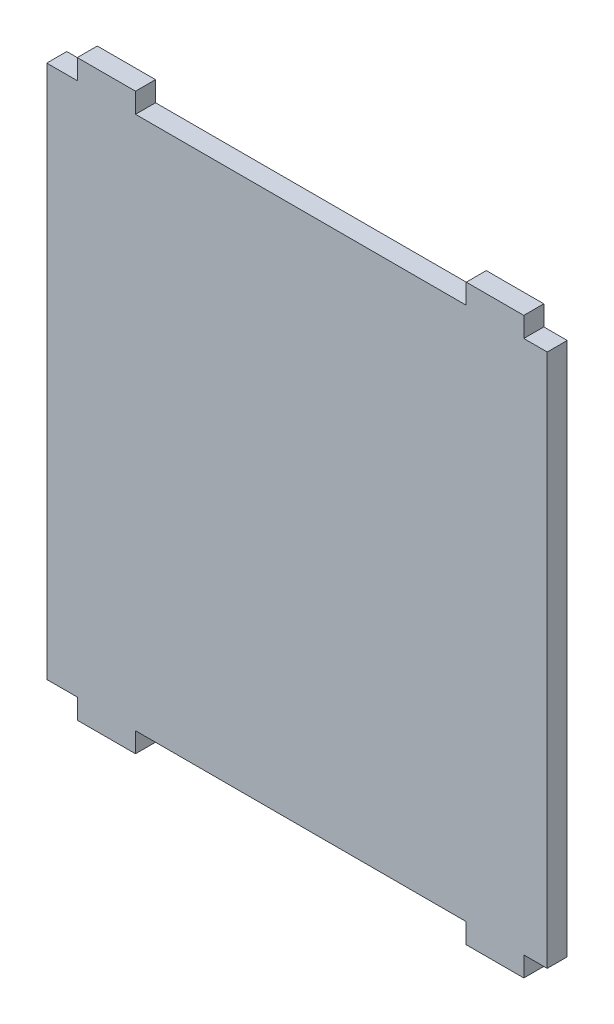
from build123d import *

# Parameters (mm, degrees)
ESQUISSE1_W        = 74.999694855
ESQUISSE1_H        = 80
BOSS_EXTRU_1_DEPTH = 3
ESQUISSE2_W        = 8.728363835
ESQUISSE2_H        = 3
ESQUISSE2_W_2      = 8.623586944
BOSS_EXTRU_2_DEPTH = 3


with BuildPart() as part:
    # Esquisse1 → Boss.-Extru.1 (new body)
    with BuildSketch(Plane.XY):
        with Locations((-19.404538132, 40)):
            Rectangle(ESQUISSE1_W, ESQUISSE1_H)
    extrude(amount=BOSS_EXTRU_1_DEPTH)

    # Esquisse2 → Boss.-Extru.2 (add)
    with BuildSketch(Plane.XY.offset(3)):
        with Locations((-47.969018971, -1.5)):
            Rectangle(ESQUISSE2_W, ESQUISSE2_H)
        with Locations((10.272461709, -1.5)):
            Rectangle(ESQUISSE2_W_2, ESQUISSE2_H)
        with Locations((10.272461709, 81.5)):
            Rectangle(ESQUISSE2_W_2, ESQUISSE2_H)
        with Locations((-47.969018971, 81.5)):
            Rectangle(ESQUISSE2_W, ESQUISSE2_H)
    extrude(amount=-BOSS_EXTRU_2_DEPTH)


solid = part.part
